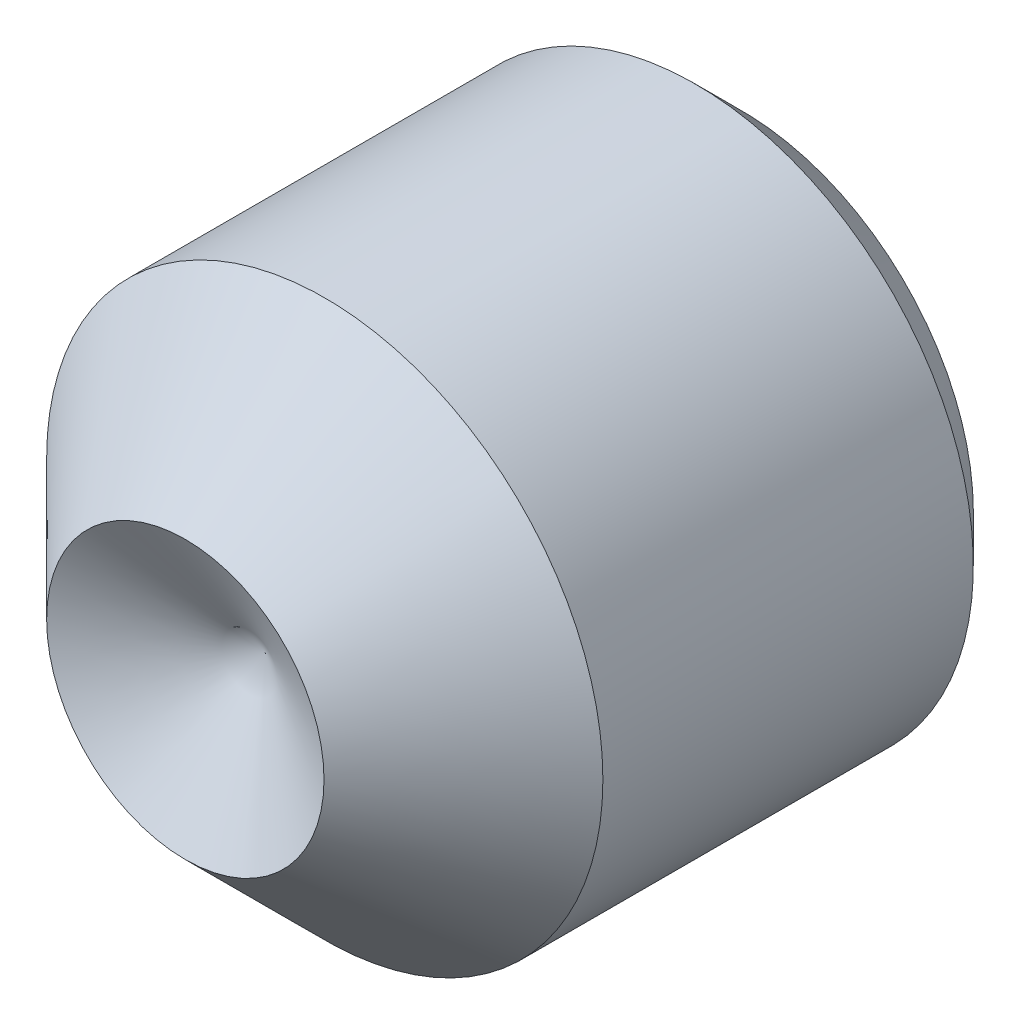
ISO-10303-21;
HEADER;
FILE_DESCRIPTION(('STEP AP214'),'2;1');
FILE_NAME('part.step','',(''),(''),'','','');
FILE_SCHEMA(('AUTOMOTIVE_DESIGN { 1 0 10303 214 1 1 1 1 }'));
ENDSEC;
DATA;
#1=APPLICATION_CONTEXT('core data for automotive mechanical design processes');
#2=APPLICATION_PROTOCOL_DEFINITION('international standard','automotive_design',2000,#1);
#3=PRODUCT_CONTEXT('',#1,'mechanical');
#4=PRODUCT('Part','Part','',(#3));
#5=PRODUCT_RELATED_PRODUCT_CATEGORY('part','',(#4));
#6=PRODUCT_DEFINITION_FORMATION('','',#4);
#7=PRODUCT_DEFINITION_CONTEXT('part definition',#1,'design');
#8=PRODUCT_DEFINITION('design','',#6,#7);
#9=PRODUCT_DEFINITION_SHAPE('','',#8);
#10=(LENGTH_UNIT() NAMED_UNIT(*) SI_UNIT(.MILLI.,.METRE.));
#11=(NAMED_UNIT(*) PLANE_ANGLE_UNIT() SI_UNIT($,.RADIAN.));
#12=(NAMED_UNIT(*) SI_UNIT($,.STERADIAN.) SOLID_ANGLE_UNIT());
#13=UNCERTAINTY_MEASURE_WITH_UNIT(LENGTH_MEASURE(1.E-05),#10,'distance_accuracy_value','');
#14=(GEOMETRIC_REPRESENTATION_CONTEXT(3) GLOBAL_UNCERTAINTY_ASSIGNED_CONTEXT((#13)) GLOBAL_UNIT_ASSIGNED_CONTEXT((#10,
#11,#12)) REPRESENTATION_CONTEXT('',''));
#15=CARTESIAN_POINT('',(0.,0.,0.));
#16=DIRECTION('',(0.,0.,1.));
#17=DIRECTION('',(1.,0.,0.));
#18=AXIS2_PLACEMENT_3D('',#15,#16,#17);
#19=CARTESIAN_POINT('',(0.,0.,-10.585154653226));
#20=DIRECTION('',(0.,0.,-1.));
#21=DIRECTION('',(-1.,0.,0.));
#22=AXIS2_PLACEMENT_3D('',#19,#20,#21);
#23=CYLINDRICAL_SURFACE('',#22,4.7625);
#24=CARTESIAN_POINT('',(0.,0.,0.793749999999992));
#25=DIRECTION('',(0.,0.,-1.));
#26=DIRECTION('',(-1.,0.,0.));
#27=AXIS2_PLACEMENT_3D('',#24,#25,#26);
#28=CIRCLE('',#27,4.7625);
#29=CARTESIAN_POINT('',(-4.7625,0.,0.793749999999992));
#30=VERTEX_POINT('',#29);
#31=EDGE_CURVE('E58',#30,#30,#28,.T.);
#32=ORIENTED_EDGE('',*,*,#31,.F.);
#33=EDGE_LOOP('',(#32));
#34=FACE_BOUND('',#33,.T.);
#35=CARTESIAN_POINT('',(0.,0.,7.13739999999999));
#36=DIRECTION('',(0.,0.,1.));
#37=DIRECTION('',(1.,0.,0.));
#38=AXIS2_PLACEMENT_3D('',#35,#36,#37);
#39=CIRCLE('',#38,4.7625);
#40=CARTESIAN_POINT('',(4.7625,0.,7.13739999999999));
#41=VERTEX_POINT('',#40);
#42=EDGE_CURVE('E188',#41,#41,#39,.T.);
#43=ORIENTED_EDGE('',*,*,#42,.F.);
#44=EDGE_LOOP('',(#43));
#45=FACE_BOUND('',#44,.T.);
#46=ADVANCED_FACE('F49',(#34,#45),#23,.T.);
#47=CARTESIAN_POINT('',(0.,0.,0.));
#48=DIRECTION('',(0.,0.,1.));
#49=DIRECTION('',(1.,0.,0.));
#50=AXIS2_PLACEMENT_3D('',#47,#48,#49);
#51=PLANE('',#50);
#52=DIRECTION('',(-0.5,-0.866025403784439,0.));
#53=VECTOR('',#52,1.);
#54=CARTESIAN_POINT('',(2.74963065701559,0.,0.));
#55=LINE('',#54,#53);
#56=CARTESIAN_POINT('',(2.74963065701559,0.,0.));
#57=VERTEX_POINT('',#56);
#58=CARTESIAN_POINT('',(1.3748153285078,-2.38125,0.));
#59=VERTEX_POINT('',#58);
#60=EDGE_CURVE('E148',#57,#59,#55,.T.);
#61=ORIENTED_EDGE('',*,*,#60,.F.);
#62=DIRECTION('',(0.5,-0.866025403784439,0.));
#63=VECTOR('',#62,1.);
#64=CARTESIAN_POINT('',(1.3748153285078,2.38125,0.));
#65=LINE('',#64,#63);
#66=CARTESIAN_POINT('',(1.3748153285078,2.38125,0.));
#67=VERTEX_POINT('',#66);
#68=EDGE_CURVE('E65',#67,#57,#65,.T.);
#69=ORIENTED_EDGE('',*,*,#68,.F.);
#70=DIRECTION('',(1.,0.,0.));
#71=VECTOR('',#70,1.);
#72=CARTESIAN_POINT('',(-1.3748153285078,2.38125,0.));
#73=LINE('',#72,#71);
#74=CARTESIAN_POINT('',(-1.3748153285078,2.38125,0.));
#75=VERTEX_POINT('',#74);
#76=EDGE_CURVE('E162',#75,#67,#73,.T.);
#77=ORIENTED_EDGE('',*,*,#76,.F.);
#78=DIRECTION('',(0.5,0.866025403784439,0.));
#79=VECTOR('',#78,1.);
#80=CARTESIAN_POINT('',(-2.74963065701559,0.,0.));
#81=LINE('',#80,#79);
#82=CARTESIAN_POINT('',(-2.74963065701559,0.,0.));
#83=VERTEX_POINT('',#82);
#84=EDGE_CURVE('E159',#83,#75,#81,.T.);
#85=ORIENTED_EDGE('',*,*,#84,.F.);
#86=DIRECTION('',(-0.5,0.866025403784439,0.));
#87=VECTOR('',#86,1.);
#88=CARTESIAN_POINT('',(-1.3748153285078,-2.38125,0.));
#89=LINE('',#88,#87);
#90=CARTESIAN_POINT('',(-1.3748153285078,-2.38125,0.));
#91=VERTEX_POINT('',#90);
#92=EDGE_CURVE('E115',#91,#83,#89,.T.);
#93=ORIENTED_EDGE('',*,*,#92,.F.);
#94=DIRECTION('',(-1.,0.,0.));
#95=VECTOR('',#94,1.);
#96=CARTESIAN_POINT('',(1.3748153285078,-2.38125,0.));
#97=LINE('',#96,#95);
#98=EDGE_CURVE('E153',#59,#91,#97,.T.);
#99=ORIENTED_EDGE('',*,*,#98,.F.);
#100=EDGE_LOOP('',(#61,#69,#77,#85,#93,#99));
#101=FACE_BOUND('',#100,.T.);
#102=CARTESIAN_POINT('',(0.,0.,0.));
#103=DIRECTION('',(0.,0.,-1.));
#104=DIRECTION('',(-1.,0.,0.));
#105=AXIS2_PLACEMENT_3D('',#102,#103,#104);
#106=CIRCLE('',#105,3.96875);
#107=CARTESIAN_POINT('',(-3.96875,0.,0.));
#108=VERTEX_POINT('',#107);
#109=EDGE_CURVE('E11',#108,#108,#106,.T.);
#110=ORIENTED_EDGE('',*,*,#109,.T.);
#111=EDGE_LOOP('',(#110));
#112=FACE_BOUND('',#111,.T.);
#113=ADVANCED_FACE('F51',(#101,#112),#51,.F.);
#114=CARTESIAN_POINT('',(0.,0.,0.793749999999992));
#115=DIRECTION('',(0.,0.,1.));
#116=DIRECTION('',(1.,0.,0.));
#117=AXIS2_PLACEMENT_3D('',#114,#115,#116);
#118=CONICAL_SURFACE('',#117,4.7625,0.785398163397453);
#119=ORIENTED_EDGE('',*,*,#109,.F.);
#120=EDGE_LOOP('',(#119));
#121=FACE_BOUND('',#120,.T.);
#122=ORIENTED_EDGE('',*,*,#31,.T.);
#123=EDGE_LOOP('',(#122));
#124=FACE_BOUND('',#123,.T.);
#125=ADVANCED_FACE('F181',(#121,#124),#118,.T.);
#126=CARTESIAN_POINT('',(1.3748153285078,2.38125,2.5));
#127=DIRECTION('',(0.866025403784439,0.5,0.));
#128=DIRECTION('',(-0.5,0.866025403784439,0.));
#129=AXIS2_PLACEMENT_3D('',#126,#127,#128);
#130=PLANE('',#129);
#131=ORIENTED_EDGE('',*,*,#68,.T.);
#132=DIRECTION('',(0.,0.,-1.));
#133=VECTOR('',#132,1.);
#134=CARTESIAN_POINT('',(2.74963065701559,0.,2.5));
#135=LINE('',#134,#133);
#136=CARTESIAN_POINT('',(2.74963065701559,0.,2.5));
#137=VERTEX_POINT('',#136);
#138=EDGE_CURVE('E96',#137,#57,#135,.T.);
#139=ORIENTED_EDGE('',*,*,#138,.F.);
#140=DIRECTION('',(0.5,-0.866025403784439,0.));
#141=VECTOR('',#140,1.);
#142=CARTESIAN_POINT('',(1.3748153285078,2.38125,2.5));
#143=LINE('',#142,#141);
#144=CARTESIAN_POINT('',(1.3748153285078,2.38125,2.5));
#145=VERTEX_POINT('',#144);
#146=EDGE_CURVE('E165',#145,#137,#143,.T.);
#147=ORIENTED_EDGE('',*,*,#146,.F.);
#148=DIRECTION('',(0.,0.,-1.));
#149=VECTOR('',#148,1.);
#150=CARTESIAN_POINT('',(1.3748153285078,2.38125,2.5));
#151=LINE('',#150,#149);
#152=EDGE_CURVE('E73',#145,#67,#151,.T.);
#153=ORIENTED_EDGE('',*,*,#152,.T.);
#154=EDGE_LOOP('',(#131,#139,#147,#153));
#155=FACE_BOUND('',#154,.T.);
#156=ADVANCED_FACE('F211',(#155),#130,.F.);
#157=CARTESIAN_POINT('',(-1.3748153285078,2.38125,2.5));
#158=DIRECTION('',(0.,1.,0.));
#159=DIRECTION('',(-1.,0.,0.));
#160=AXIS2_PLACEMENT_3D('',#157,#158,#159);
#161=PLANE('',#160);
#162=ORIENTED_EDGE('',*,*,#76,.T.);
#163=ORIENTED_EDGE('',*,*,#152,.F.);
#164=DIRECTION('',(1.,0.,0.));
#165=VECTOR('',#164,1.);
#166=CARTESIAN_POINT('',(-1.3748153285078,2.38125,2.5));
#167=LINE('',#166,#165);
#168=CARTESIAN_POINT('',(-1.3748153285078,2.38125,2.5));
#169=VERTEX_POINT('',#168);
#170=EDGE_CURVE('E129',#169,#145,#167,.T.);
#171=ORIENTED_EDGE('',*,*,#170,.F.);
#172=DIRECTION('',(0.,0.,-1.));
#173=VECTOR('',#172,1.);
#174=CARTESIAN_POINT('',(-1.3748153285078,2.38125,2.5));
#175=LINE('',#174,#173);
#176=EDGE_CURVE('E120',#169,#75,#175,.T.);
#177=ORIENTED_EDGE('',*,*,#176,.T.);
#178=EDGE_LOOP('',(#162,#163,#171,#177));
#179=FACE_BOUND('',#178,.T.);
#180=ADVANCED_FACE('F209',(#179),#161,.F.);
#181=CARTESIAN_POINT('',(-2.74963065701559,0.,2.5));
#182=DIRECTION('',(-0.866025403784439,0.5,0.));
#183=DIRECTION('',(-0.5,-0.866025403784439,0.));
#184=AXIS2_PLACEMENT_3D('',#181,#182,#183);
#185=PLANE('',#184);
#186=ORIENTED_EDGE('',*,*,#84,.T.);
#187=ORIENTED_EDGE('',*,*,#176,.F.);
#188=DIRECTION('',(0.5,0.866025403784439,0.));
#189=VECTOR('',#188,1.);
#190=CARTESIAN_POINT('',(-2.74963065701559,0.,2.5));
#191=LINE('',#190,#189);
#192=CARTESIAN_POINT('',(-2.74963065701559,0.,2.5));
#193=VERTEX_POINT('',#192);
#194=EDGE_CURVE('E124',#193,#169,#191,.T.);
#195=ORIENTED_EDGE('',*,*,#194,.F.);
#196=DIRECTION('',(0.,0.,-1.));
#197=VECTOR('',#196,1.);
#198=CARTESIAN_POINT('',(-2.74963065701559,0.,2.5));
#199=LINE('',#198,#197);
#200=EDGE_CURVE('E108',#193,#83,#199,.T.);
#201=ORIENTED_EDGE('',*,*,#200,.T.);
#202=EDGE_LOOP('',(#186,#187,#195,#201));
#203=FACE_BOUND('',#202,.T.);
#204=ADVANCED_FACE('F125',(#203),#185,.F.);
#205=CARTESIAN_POINT('',(-1.3748153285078,-2.38125,2.5));
#206=DIRECTION('',(-0.866025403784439,-0.5,0.));
#207=DIRECTION('',(0.5,-0.866025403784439,0.));
#208=AXIS2_PLACEMENT_3D('',#205,#206,#207);
#209=PLANE('',#208);
#210=ORIENTED_EDGE('',*,*,#92,.T.);
#211=ORIENTED_EDGE('',*,*,#200,.F.);
#212=DIRECTION('',(-0.5,0.866025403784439,0.));
#213=VECTOR('',#212,1.);
#214=CARTESIAN_POINT('',(-1.3748153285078,-2.38125,2.5));
#215=LINE('',#214,#213);
#216=CARTESIAN_POINT('',(-1.3748153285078,-2.38125,2.5));
#217=VERTEX_POINT('',#216);
#218=EDGE_CURVE('E112',#217,#193,#215,.T.);
#219=ORIENTED_EDGE('',*,*,#218,.F.);
#220=DIRECTION('',(0.,0.,-1.));
#221=VECTOR('',#220,1.);
#222=CARTESIAN_POINT('',(-1.3748153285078,-2.38125,2.5));
#223=LINE('',#222,#221);
#224=EDGE_CURVE('E121',#217,#91,#223,.T.);
#225=ORIENTED_EDGE('',*,*,#224,.T.);
#226=EDGE_LOOP('',(#210,#211,#219,#225));
#227=FACE_BOUND('',#226,.T.);
#228=ADVANCED_FACE('F110',(#227),#209,.F.);
#229=CARTESIAN_POINT('',(1.3748153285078,-2.38125,2.5));
#230=DIRECTION('',(0.,-1.,0.));
#231=DIRECTION('',(0.,0.,-1.));
#232=AXIS2_PLACEMENT_3D('',#229,#230,#231);
#233=PLANE('',#232);
#234=ORIENTED_EDGE('',*,*,#98,.T.);
#235=ORIENTED_EDGE('',*,*,#224,.F.);
#236=DIRECTION('',(-1.,0.,0.));
#237=VECTOR('',#236,1.);
#238=CARTESIAN_POINT('',(1.3748153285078,-2.38125,2.5));
#239=LINE('',#238,#237);
#240=CARTESIAN_POINT('',(1.3748153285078,-2.38125,2.5));
#241=VERTEX_POINT('',#240);
#242=EDGE_CURVE('E135',#241,#217,#239,.T.);
#243=ORIENTED_EDGE('',*,*,#242,.F.);
#244=DIRECTION('',(0.,0.,-1.));
#245=VECTOR('',#244,1.);
#246=CARTESIAN_POINT('',(1.3748153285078,-2.38125,2.5));
#247=LINE('',#246,#245);
#248=EDGE_CURVE('E172',#241,#59,#247,.T.);
#249=ORIENTED_EDGE('',*,*,#248,.T.);
#250=EDGE_LOOP('',(#234,#235,#243,#249));
#251=FACE_BOUND('',#250,.T.);
#252=ADVANCED_FACE('F205',(#251),#233,.F.);
#253=CARTESIAN_POINT('',(2.74963065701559,0.,2.5));
#254=DIRECTION('',(0.866025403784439,-0.5,0.));
#255=DIRECTION('',(0.5,0.866025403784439,0.));
#256=AXIS2_PLACEMENT_3D('',#253,#254,#255);
#257=PLANE('',#256);
#258=ORIENTED_EDGE('',*,*,#60,.T.);
#259=ORIENTED_EDGE('',*,*,#248,.F.);
#260=DIRECTION('',(-0.5,-0.866025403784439,0.));
#261=VECTOR('',#260,1.);
#262=CARTESIAN_POINT('',(2.74963065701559,0.,2.5));
#263=LINE('',#262,#261);
#264=EDGE_CURVE('E140',#137,#241,#263,.T.);
#265=ORIENTED_EDGE('',*,*,#264,.F.);
#266=ORIENTED_EDGE('',*,*,#138,.T.);
#267=EDGE_LOOP('',(#258,#259,#265,#266));
#268=FACE_BOUND('',#267,.T.);
#269=ADVANCED_FACE('F201',(#268),#257,.F.);
#270=CARTESIAN_POINT('',(1.3748153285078,2.38125,2.5));
#271=DIRECTION('',(0.,0.,1.));
#272=DIRECTION('',(1.,0.,0.));
#273=AXIS2_PLACEMENT_3D('',#270,#271,#272);
#274=PLANE('',#273);
#275=ORIENTED_EDGE('',*,*,#146,.T.);
#276=ORIENTED_EDGE('',*,*,#264,.T.);
#277=ORIENTED_EDGE('',*,*,#242,.T.);
#278=ORIENTED_EDGE('',*,*,#218,.T.);
#279=ORIENTED_EDGE('',*,*,#194,.T.);
#280=ORIENTED_EDGE('',*,*,#170,.T.);
#281=EDGE_LOOP('',(#275,#276,#277,#278,#279,#280));
#282=FACE_BOUND('',#281,.T.);
#283=ADVANCED_FACE('F132',(#282),#274,.F.);
#284=CARTESIAN_POINT('',(0.,0.,8.15385084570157));
#285=DIRECTION('',(0.,0.,1.));
#286=DIRECTION('',(1.,0.,0.));
#287=AXIS2_PLACEMENT_3D('',#284,#285,#286);
#288=CONICAL_SURFACE('',#287,0.,1.0471975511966);
#289=CARTESIAN_POINT('',(0.,0.,9.525));
#290=DIRECTION('',(0.,0.,1.));
#291=DIRECTION('',(1.,0.,0.));
#292=AXIS2_PLACEMENT_3D('',#289,#290,#291);
#293=CIRCLE('',#292,2.3749);
#294=CARTESIAN_POINT('',(2.3749,0.,9.525));
#295=VERTEX_POINT('',#294);
#296=EDGE_CURVE('E149',#295,#295,#293,.T.);
#297=ORIENTED_EDGE('',*,*,#296,.T.);
#298=EDGE_LOOP('',(#297));
#299=FACE_BOUND('',#298,.T.);
#300=CARTESIAN_POINT('',(0.,0.,8.15385084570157));
#301=VERTEX_POINT('',#300);
#302=VERTEX_LOOP('',#301);
#303=FACE_BOUND('',#302,.T.);
#304=ADVANCED_FACE('F298',(#299,#303),#288,.F.);
#305=CARTESIAN_POINT('',(0.,0.,9.525));
#306=DIRECTION('',(0.,0.,-1.));
#307=DIRECTION('',(-1.,0.,0.));
#308=AXIS2_PLACEMENT_3D('',#305,#306,#307);
#309=CONICAL_SURFACE('',#308,2.3749,0.785398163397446);
#310=ORIENTED_EDGE('',*,*,#42,.T.);
#311=EDGE_LOOP('',(#310));
#312=FACE_BOUND('',#311,.T.);
#313=ORIENTED_EDGE('',*,*,#296,.F.);
#314=EDGE_LOOP('',(#313));
#315=FACE_BOUND('',#314,.T.);
#316=ADVANCED_FACE('F315',(#312,#315),#309,.T.);
#317=CLOSED_SHELL('',(#46,#113,#125,#156,#180,#204,#228,#252,#269,#283,#304,#316));
#318=MANIFOLD_SOLID_BREP('B2',#317);
#319=ADVANCED_BREP_SHAPE_REPRESENTATION('',(#18,#318),#14);
#320=SHAPE_DEFINITION_REPRESENTATION(#9,#319);
ENDSEC;
END-ISO-10303-21;
